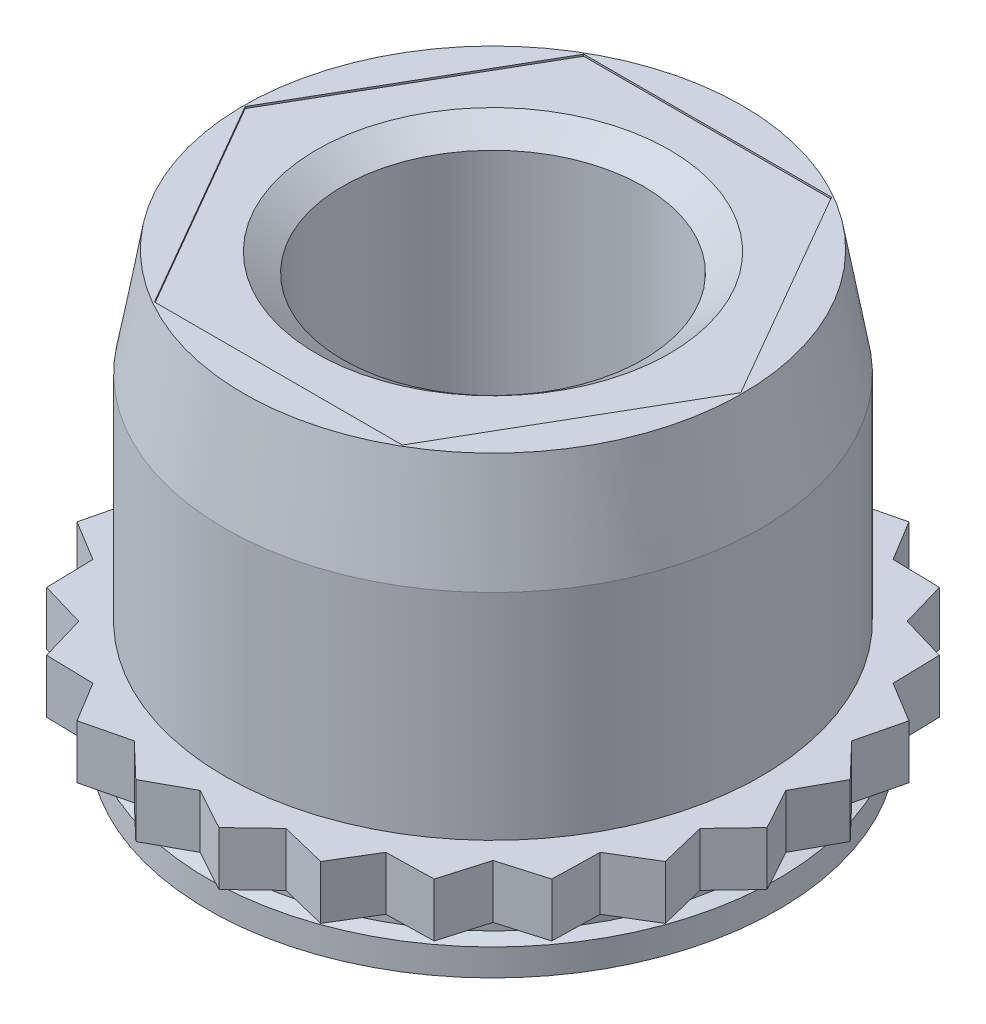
from build123d import *

# Parameters (mm, degrees)
CLINCHCUT_START    = -0.75
CLINCHCUT_DEPTH    = 0.75
CLINCHCUTPAT_COUNT = 24
CLINCHCUTPAT_ANGLE = 345
HEXCUT_DEPTH       = 0.0254


with BuildPart() as part:
    # BodySke → Body (revolve)
    with BuildSketch(Plane.XY, mode=Mode.PRIVATE) as body_sk:
        Polygon((3.78575, -1.071611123), (3.78575, -0.75), (4.45, -0.75), (4.45, 0), (3.75, 0), (3.75, 3), (3.485509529, 4.5), (2.1, 4.5), (2.1, -1.5), (3.985, -1.5), (3.985, -1.125), align=None)
    revolve(body_sk.sketch.rotate(Axis((0, -1.125, 0), (0, 1, 0)), 90), axis=Axis((0, -1.125, 0), (0, 1, 0)))

    # EndChamferSke → EndChamfer (revolve, cut)
    with BuildSketch(Plane.XY, mode=Mode.PRIVATE) as endchamfer_sk:
        Polygon((2.5, -1.754), (2.5, -1.49746), (2.1, -1.217481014), (2.1, -1.754), align=None)
        Polygon((2.5, 4.49746), (2.5, 4.754), (2.1, 4.754), (2.1, 4.217481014), align=None)
    revolve(endchamfer_sk.sketch.rotate(Axis((0, -2.54, 0), (0, 1, 0)), 90), axis=Axis((0, -2.54, 0), (0, 1, 0)), mode=Mode.SUBTRACT)

    # CliRinCutSke → ClinchCut (cut)
    with BuildSketch(Plane.XZ.offset(0.75).offset(CLINCHCUT_START)):
        with BuildLine():
            Line((0.580841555, 4.411929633), (0, 4.094))
            Line((0, 4.094), (-0.580841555, 4.411929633))
            ThreePointArc((-0.580841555, 4.411929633), (0, 4.45), (0.580841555, 4.411929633))
        make_face()
    clinchcut = extrude(amount=CLINCHCUT_DEPTH, mode=Mode.SUBTRACT)

    # ClinchCutPat: ClinchCut ×24 about axis
    clinchcutpat_axis = Axis((0, 0, 0), (0, 1, 0))
    for i in range(1, CLINCHCUTPAT_COUNT):
        add(clinchcut.rotate(clinchcutpat_axis, i * CLINCHCUTPAT_ANGLE / (CLINCHCUTPAT_COUNT - 1)), mode=Mode.SUBTRACT)

    # HexCutSke → HexCut (cut)
    with BuildSketch(Plane(origin=(0, 4.5, 0), x_dir=(-1, 0, 0), z_dir=(0, 1, 0))):
        Polygon((-1.732050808, 3), (1.732050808, 3), (3.464101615, 0), (1.732050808, -3), (-1.732050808, -3), (-3.464101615, 0), align=None)
    extrude(amount=-HEXCUT_DEPTH, mode=Mode.SUBTRACT)


solid = part.part
